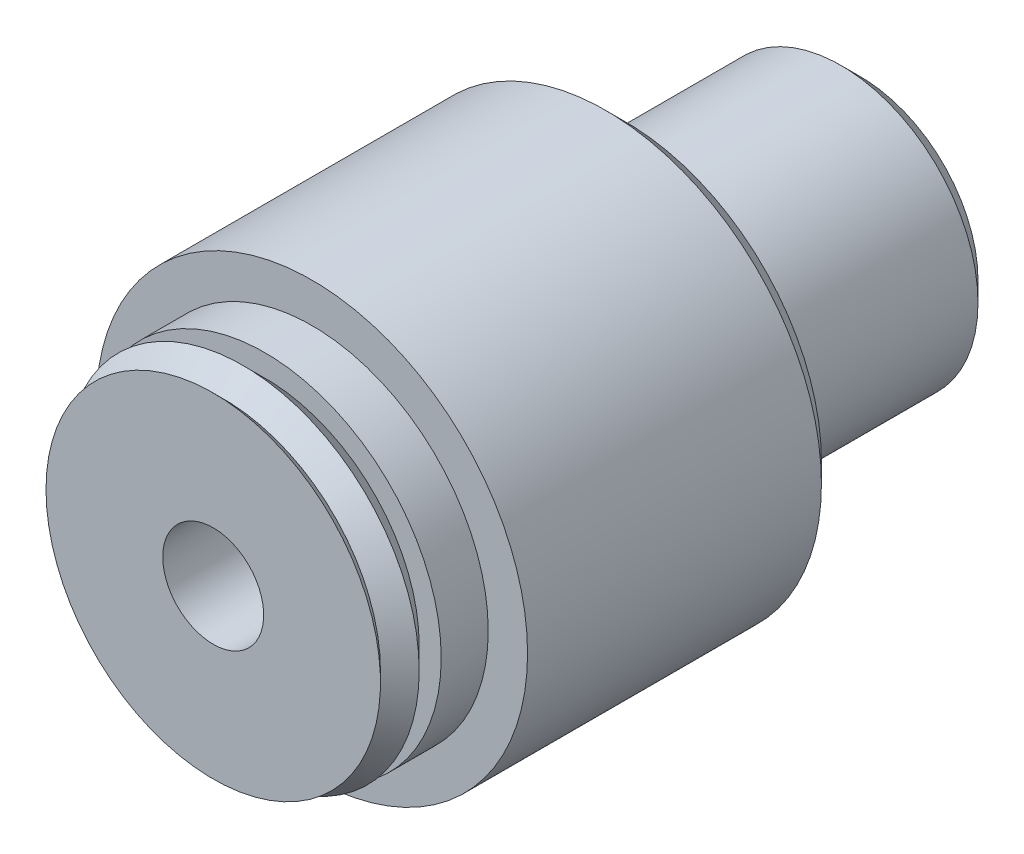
from build123d import *

# Parameters (mm, degrees)
SKETCH4_R                        = 8.7376
DOUBLE_ACTING_STUD_BODY_DEPTH    = 12.7
SKETCH5_R                        = 5.55625
DOUBLE_ACTING_STUD_BODY_2_DEPTH  = 9.525
DOUBLE_ACTING_STUD_CHAMFER_SIZE  = 0.79375
SKETCH8_R                        = 2.032
DOUBLE_ACTING_STUD_PORT_A1_DEPTH = 29.988760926
SKETCH3_R                        = 2.0447
HOLE_CUT_DEPTH                   = 29.988760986


with BuildPart() as part:
    # Sketch1 → Base (revolve)
    with BuildSketch(Plane(origin=(0, 0, 0), x_dir=(0, 0, -1), z_dir=(1, 0, 0)), mode=Mode.PRIVATE) as base_sk:
        Polygon((0, 0), (0, 6.77545), (0.41656, 6.35889), (1.20142, 7.14375), (2.093214, 6.251956), (2.093214, 7.14375), (3.998214, 7.14375), (3.998214, 0), align=None)
    revolve(base_sk.sketch.rotate(Axis((0, 0, -71.294124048), (0, 0, 1)), 90), axis=Axis((0, 0, -71.294124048), (0, 0, 1)))

    # Sketch4 → Double Acting Stud Body (add)
    with BuildSketch(Plane.XY.offset(-3.998214)):
        Circle(SKETCH4_R)
    extrude(amount=-DOUBLE_ACTING_STUD_BODY_DEPTH)

    # Sketch5 → Double Acting Stud Body 2 (add)
    with BuildSketch(Plane(origin=(0, 0, -16.698214), x_dir=(-1, 0, 0), z_dir=(0, 0, -1))):
        with Locations(Location((0, 0, 0), (0, 0, 180))):
            Circle(SKETCH5_R)
    extrude(amount=DOUBLE_ACTING_STUD_BODY_2_DEPTH)

    # Double Acting Stud Chamfer
    double_acting_stud_chamfer_edges = [part.edges().sort_by_distance(p)[0] for p in [
        (-8.7376, 0, -16.698214),
        (-5.55625, 0, -26.223214),
    ]]
    chamfer(double_acting_stud_chamfer_edges, length=DOUBLE_ACTING_STUD_CHAMFER_SIZE)

    # Sketch8 → Double Acting Stud Port A1 (cut, through all)
    with BuildSketch(Plane(origin=(0, 0, 0), x_dir=(0, 0, -1), z_dir=(1, 0, 0))):
        with Locations((7.173214, 0)):
            Circle(SKETCH8_R)
    extrude(amount=-DOUBLE_ACTING_STUD_PORT_A1_DEPTH, mode=Mode.SUBTRACT)

    # Sketch3 → Hole Cut (cut, through all)
    with BuildSketch(Plane(origin=(0, 0, 0), x_dir=(-1, 0, 0), z_dir=(0, 0, -1))):
        Circle(SKETCH3_R)
    extrude(amount=HOLE_CUT_DEPTH, mode=Mode.SUBTRACT)


solid = part.part
